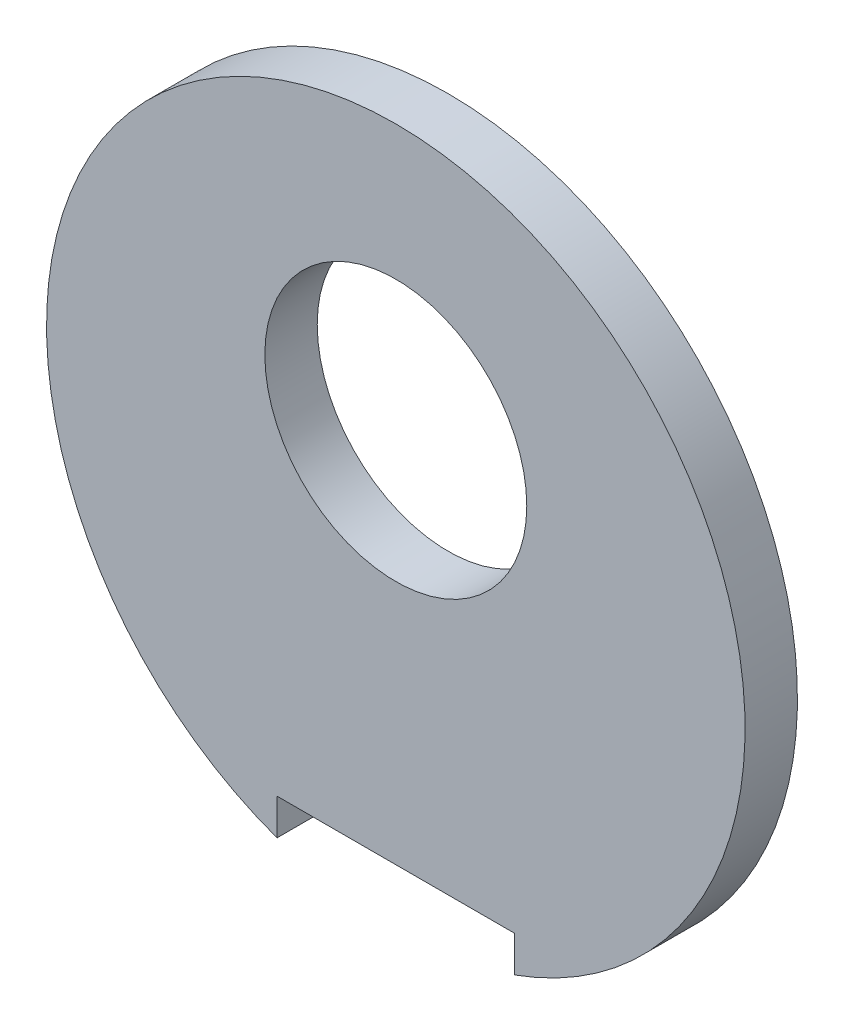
ISO-10303-21;
HEADER;
FILE_DESCRIPTION(('STEP AP214'),'2;1');
FILE_NAME('part.step','',(''),(''),'','','');
FILE_SCHEMA(('AUTOMOTIVE_DESIGN { 1 0 10303 214 1 1 1 1 }'));
ENDSEC;
DATA;
#1=APPLICATION_CONTEXT('core data for automotive mechanical design processes');
#2=APPLICATION_PROTOCOL_DEFINITION('international standard','automotive_design',2000,#1);
#3=PRODUCT_CONTEXT('',#1,'mechanical');
#4=PRODUCT('Part','Part','',(#3));
#5=PRODUCT_RELATED_PRODUCT_CATEGORY('part','',(#4));
#6=PRODUCT_DEFINITION_FORMATION('','',#4);
#7=PRODUCT_DEFINITION_CONTEXT('part definition',#1,'design');
#8=PRODUCT_DEFINITION('design','',#6,#7);
#9=PRODUCT_DEFINITION_SHAPE('','',#8);
#10=(LENGTH_UNIT() NAMED_UNIT(*) SI_UNIT(.MILLI.,.METRE.));
#11=(NAMED_UNIT(*) PLANE_ANGLE_UNIT() SI_UNIT($,.RADIAN.));
#12=(NAMED_UNIT(*) SI_UNIT($,.STERADIAN.) SOLID_ANGLE_UNIT());
#13=UNCERTAINTY_MEASURE_WITH_UNIT(LENGTH_MEASURE(1.E-05),#10,'distance_accuracy_value','');
#14=(GEOMETRIC_REPRESENTATION_CONTEXT(3) GLOBAL_UNCERTAINTY_ASSIGNED_CONTEXT((#13)) GLOBAL_UNIT_ASSIGNED_CONTEXT((#10,
#11,#12)) REPRESENTATION_CONTEXT('',''));
#15=CARTESIAN_POINT('',(0.,0.,0.));
#16=DIRECTION('',(0.,0.,1.));
#17=DIRECTION('',(1.,0.,0.));
#18=AXIS2_PLACEMENT_3D('',#15,#16,#17);
#19=CARTESIAN_POINT('',(0.,0.,3.81));
#20=DIRECTION('',(0.,0.,1.));
#21=DIRECTION('',(1.,0.,0.));
#22=AXIS2_PLACEMENT_3D('',#19,#20,#21);
#23=PLANE('',#22);
#24=CARTESIAN_POINT('',(0.,6.096,3.81));
#25=DIRECTION('',(0.,0.,1.));
#26=DIRECTION('',(1.,0.,0.));
#27=AXIS2_PLACEMENT_3D('',#24,#25,#26);
#28=CIRCLE('',#27,9.525);
#29=CARTESIAN_POINT('',(-9.525,6.096,3.81));
#30=VERTEX_POINT('',#29);
#31=EDGE_CURVE('E99',#30,#30,#28,.T.);
#32=ORIENTED_EDGE('',*,*,#31,.F.);
#33=EDGE_LOOP('',(#32));
#34=FACE_BOUND('',#33,.T.);
#35=CARTESIAN_POINT('',(0.,0.,3.81));
#36=DIRECTION('',(0.,0.,1.));
#37=DIRECTION('',(1.,0.,0.));
#38=AXIS2_PLACEMENT_3D('',#35,#36,#37);
#39=CIRCLE('',#38,25.4);
#40=CARTESIAN_POINT('',(8.636,-23.8868060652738,3.81));
#41=VERTEX_POINT('',#40);
#42=CARTESIAN_POINT('',(-8.63599999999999,-23.8868060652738,3.81));
#43=VERTEX_POINT('',#42);
#44=EDGE_CURVE('E103',#41,#43,#39,.T.);
#45=ORIENTED_EDGE('',*,*,#44,.T.);
#46=DIRECTION('',(0.,-1.,0.));
#47=VECTOR('',#46,1.);
#48=CARTESIAN_POINT('',(-8.63599999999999,-21.2598,3.81));
#49=LINE('',#48,#47);
#50=CARTESIAN_POINT('',(-8.63599999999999,-21.2598,3.81));
#51=VERTEX_POINT('',#50);
#52=EDGE_CURVE('E82',#51,#43,#49,.T.);
#53=ORIENTED_EDGE('',*,*,#52,.F.);
#54=DIRECTION('',(-1.,0.,0.));
#55=VECTOR('',#54,1.);
#56=CARTESIAN_POINT('',(-8.63599999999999,-21.2598,3.81));
#57=LINE('',#56,#55);
#58=CARTESIAN_POINT('',(8.636,-21.2598,3.81));
#59=VERTEX_POINT('',#58);
#60=EDGE_CURVE('E94',#59,#51,#57,.T.);
#61=ORIENTED_EDGE('',*,*,#60,.F.);
#62=DIRECTION('',(0.,1.,0.));
#63=VECTOR('',#62,1.);
#64=CARTESIAN_POINT('',(8.636,-27.7961647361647,3.81));
#65=LINE('',#64,#63);
#66=EDGE_CURVE('E69',#41,#59,#65,.T.);
#67=ORIENTED_EDGE('',*,*,#66,.F.);
#68=EDGE_LOOP('',(#45,#53,#61,#67));
#69=FACE_BOUND('',#68,.T.);
#70=ADVANCED_FACE('F31',(#34,#69),#23,.T.);
#71=CARTESIAN_POINT('',(0.,0.,0.));
#72=DIRECTION('',(0.,0.,1.));
#73=DIRECTION('',(1.,0.,0.));
#74=AXIS2_PLACEMENT_3D('',#71,#72,#73);
#75=PLANE('',#74);
#76=CARTESIAN_POINT('',(0.,6.096,0.));
#77=DIRECTION('',(0.,0.,1.));
#78=DIRECTION('',(1.,0.,0.));
#79=AXIS2_PLACEMENT_3D('',#76,#77,#78);
#80=CIRCLE('',#79,9.525);
#81=CARTESIAN_POINT('',(-9.525,6.096,0.));
#82=VERTEX_POINT('',#81);
#83=EDGE_CURVE('E72',#82,#82,#80,.T.);
#84=ORIENTED_EDGE('',*,*,#83,.T.);
#85=EDGE_LOOP('',(#84));
#86=FACE_BOUND('',#85,.T.);
#87=DIRECTION('',(0.,-1.,0.));
#88=VECTOR('',#87,1.);
#89=CARTESIAN_POINT('',(-8.63599999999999,-21.2598,0.));
#90=LINE('',#89,#88);
#91=CARTESIAN_POINT('',(-8.63599999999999,-21.2598,0.));
#92=VERTEX_POINT('',#91);
#93=CARTESIAN_POINT('',(-8.63599999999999,-23.8868060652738,0.));
#94=VERTEX_POINT('',#93);
#95=EDGE_CURVE('E88',#92,#94,#90,.T.);
#96=ORIENTED_EDGE('',*,*,#95,.T.);
#97=CARTESIAN_POINT('',(0.,0.,0.));
#98=DIRECTION('',(0.,0.,1.));
#99=DIRECTION('',(1.,0.,0.));
#100=AXIS2_PLACEMENT_3D('',#97,#98,#99);
#101=CIRCLE('',#100,25.4);
#102=CARTESIAN_POINT('',(8.636,-23.8868060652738,0.));
#103=VERTEX_POINT('',#102);
#104=EDGE_CURVE('E87',#103,#94,#101,.T.);
#105=ORIENTED_EDGE('',*,*,#104,.F.);
#106=DIRECTION('',(0.,1.,0.));
#107=VECTOR('',#106,1.);
#108=CARTESIAN_POINT('',(8.636,-27.7961647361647,0.));
#109=LINE('',#108,#107);
#110=CARTESIAN_POINT('',(8.636,-21.2598,0.));
#111=VERTEX_POINT('',#110);
#112=EDGE_CURVE('E46',#103,#111,#109,.T.);
#113=ORIENTED_EDGE('',*,*,#112,.T.);
#114=DIRECTION('',(-1.,0.,0.));
#115=VECTOR('',#114,1.);
#116=CARTESIAN_POINT('',(-8.63599999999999,-21.2598,0.));
#117=LINE('',#116,#115);
#118=EDGE_CURVE('E76',#111,#92,#117,.T.);
#119=ORIENTED_EDGE('',*,*,#118,.T.);
#120=EDGE_LOOP('',(#96,#105,#113,#119));
#121=FACE_BOUND('',#120,.T.);
#122=ADVANCED_FACE('F85',(#86,#121),#75,.F.);
#123=CARTESIAN_POINT('',(0.,0.,3.81));
#124=DIRECTION('',(0.,0.,-1.));
#125=DIRECTION('',(-1.,0.,0.));
#126=AXIS2_PLACEMENT_3D('',#123,#124,#125);
#127=CYLINDRICAL_SURFACE('',#126,25.4);
#128=DIRECTION('',(0.,0.,-1.));
#129=VECTOR('',#128,1.);
#130=CARTESIAN_POINT('',(-8.63599999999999,-23.8868060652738,3.81));
#131=LINE('',#130,#129);
#132=EDGE_CURVE('E11',#43,#94,#131,.T.);
#133=ORIENTED_EDGE('',*,*,#132,.F.);
#134=ORIENTED_EDGE('',*,*,#44,.F.);
#135=DIRECTION('',(0.,0.,-1.));
#136=VECTOR('',#135,1.);
#137=CARTESIAN_POINT('',(8.636,-23.8868060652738,3.81));
#138=LINE('',#137,#136);
#139=EDGE_CURVE('E39',#103,#41,#138,.F.);
#140=ORIENTED_EDGE('',*,*,#139,.F.);
#141=ORIENTED_EDGE('',*,*,#104,.T.);
#142=EDGE_LOOP('',(#133,#134,#140,#141));
#143=FACE_BOUND('',#142,.T.);
#144=ADVANCED_FACE('F33',(#143),#127,.T.);
#145=CARTESIAN_POINT('',(0.,6.096,3.81));
#146=DIRECTION('',(0.,0.,-1.));
#147=DIRECTION('',(-1.,0.,0.));
#148=AXIS2_PLACEMENT_3D('',#145,#146,#147);
#149=CYLINDRICAL_SURFACE('',#148,9.525);
#150=CARTESIAN_POINT('',(-9.525,6.096,3.81));
#151=CARTESIAN_POINT('',(-9.525,6.096,3.7703125));
#152=CARTESIAN_POINT('',(-9.525,6.096,3.730625));
#153=CARTESIAN_POINT('',(-9.525,6.096,3.65125));
#154=CARTESIAN_POINT('',(-9.525,6.096,3.6115625));
#155=CARTESIAN_POINT('',(-9.525,6.096,3.5321875));
#156=CARTESIAN_POINT('',(-9.525,6.096,3.4925));
#157=CARTESIAN_POINT('',(-9.525,6.096,3.413125));
#158=CARTESIAN_POINT('',(-9.525,6.096,3.3734375));
#159=CARTESIAN_POINT('',(-9.525,6.096,3.2940625));
#160=CARTESIAN_POINT('',(-9.525,6.096,3.254375));
#161=CARTESIAN_POINT('',(-9.525,6.096,3.175));
#162=CARTESIAN_POINT('',(-9.525,6.096,3.1353125));
#163=CARTESIAN_POINT('',(-9.525,6.096,3.0559375));
#164=CARTESIAN_POINT('',(-9.525,6.096,3.01625));
#165=CARTESIAN_POINT('',(-9.525,6.096,2.936875));
#166=CARTESIAN_POINT('',(-9.525,6.096,2.8971875));
#167=CARTESIAN_POINT('',(-9.525,6.096,2.8178125));
#168=CARTESIAN_POINT('',(-9.525,6.096,2.778125));
#169=CARTESIAN_POINT('',(-9.525,6.096,2.69875));
#170=CARTESIAN_POINT('',(-9.525,6.096,2.6590625));
#171=CARTESIAN_POINT('',(-9.525,6.096,2.5796875));
#172=CARTESIAN_POINT('',(-9.525,6.096,2.54));
#173=CARTESIAN_POINT('',(-9.525,6.096,2.460625));
#174=CARTESIAN_POINT('',(-9.525,6.096,2.4209375));
#175=CARTESIAN_POINT('',(-9.525,6.096,2.3415625));
#176=CARTESIAN_POINT('',(-9.525,6.096,2.301875));
#177=CARTESIAN_POINT('',(-9.525,6.096,2.2225));
#178=CARTESIAN_POINT('',(-9.525,6.096,2.1828125));
#179=CARTESIAN_POINT('',(-9.525,6.096,2.1034375));
#180=CARTESIAN_POINT('',(-9.525,6.096,2.06375));
#181=CARTESIAN_POINT('',(-9.525,6.096,1.984375));
#182=CARTESIAN_POINT('',(-9.525,6.096,1.9446875));
#183=CARTESIAN_POINT('',(-9.525,6.096,1.8653125));
#184=CARTESIAN_POINT('',(-9.525,6.096,1.825625));
#185=CARTESIAN_POINT('',(-9.525,6.096,1.74625));
#186=CARTESIAN_POINT('',(-9.525,6.096,1.7065625));
#187=CARTESIAN_POINT('',(-9.525,6.096,1.6271875));
#188=CARTESIAN_POINT('',(-9.525,6.096,1.5875));
#189=CARTESIAN_POINT('',(-9.525,6.096,1.508125));
#190=CARTESIAN_POINT('',(-9.525,6.096,1.4684375));
#191=CARTESIAN_POINT('',(-9.525,6.096,1.3890625));
#192=CARTESIAN_POINT('',(-9.525,6.096,1.349375));
#193=CARTESIAN_POINT('',(-9.525,6.096,1.27));
#194=CARTESIAN_POINT('',(-9.525,6.096,1.2303125));
#195=CARTESIAN_POINT('',(-9.525,6.096,1.1509375));
#196=CARTESIAN_POINT('',(-9.525,6.096,1.11125));
#197=CARTESIAN_POINT('',(-9.525,6.096,1.031875));
#198=CARTESIAN_POINT('',(-9.525,6.096,0.9921875));
#199=CARTESIAN_POINT('',(-9.525,6.096,0.9128125));
#200=CARTESIAN_POINT('',(-9.525,6.096,0.873125));
#201=CARTESIAN_POINT('',(-9.525,6.096,0.79375));
#202=CARTESIAN_POINT('',(-9.525,6.096,0.7540625));
#203=CARTESIAN_POINT('',(-9.525,6.096,0.6746875));
#204=CARTESIAN_POINT('',(-9.525,6.096,0.635));
#205=CARTESIAN_POINT('',(-9.525,6.096,0.555625));
#206=CARTESIAN_POINT('',(-9.525,6.096,0.5159375));
#207=CARTESIAN_POINT('',(-9.525,6.096,0.4365625));
#208=CARTESIAN_POINT('',(-9.525,6.096,0.396875));
#209=CARTESIAN_POINT('',(-9.525,6.096,0.3175));
#210=CARTESIAN_POINT('',(-9.525,6.096,0.2778125));
#211=CARTESIAN_POINT('',(-9.525,6.096,0.1984375));
#212=CARTESIAN_POINT('',(-9.525,6.096,0.15875));
#213=CARTESIAN_POINT('',(-9.525,6.096,0.0793749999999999));
#214=CARTESIAN_POINT('',(-9.525,6.096,0.0396874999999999));
#215=CARTESIAN_POINT('',(-9.525,6.096,0.));
#216=B_SPLINE_CURVE_WITH_KNOTS('',3,(#150,#151,#152,#153,#154,#155,#156,#157,#158,#159,#160,
#161,#162,#163,#164,#165,#166,#167,#168,#169,#170,#171,#172,#173,#174,#175,#176,#177,#178,#179,
#180,#181,#182,#183,#184,#185,#186,#187,#188,#189,#190,#191,#192,#193,#194,#195,#196,#197,#198,
#199,#200,#201,#202,#203,#204,#205,#206,#207,#208,#209,#210,#211,#212,#213,#214,#215),
.UNSPECIFIED.,.F.,.F.,(4,2,2,2,2,2,2,2,2,2,2,2,2,2,2,2,2,2,2,2,2,2,2,2,2,2,2,2,2,2,2,2,4),(0.,
0.1190625,0.238125,0.3571875,0.47625,0.5953125,0.714375,0.8334375,0.9525,1.0715625,1.190625,
1.3096875,1.42875,1.5478125,1.666875,1.7859375,1.905,2.0240625,2.143125,2.2621875,2.38125,
2.5003125,2.619375,2.7384375,2.8575,2.9765625,3.095625,3.2146875,3.33375,3.4528125,3.571875,
3.6909375,3.81),.UNSPECIFIED.);
#217=EDGE_CURVE('BSEAM113',#30,#82,#216,.T.);
#218=ORIENTED_EDGE('',*,*,#31,.T.);
#219=ORIENTED_EDGE('',*,*,#83,.F.);
#220=ORIENTED_EDGE('',*,*,#217,.T.);
#221=ORIENTED_EDGE('',*,*,#217,.F.);
#222=EDGE_LOOP('',(#218,#220,#219,#221));
#223=FACE_BOUND('',#222,.T.);
#224=ADVANCED_FACE('F113',(#223),#149,.F.);
#225=CARTESIAN_POINT('',(-8.63599999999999,-21.2598,3.81));
#226=DIRECTION('',(1.,0.,0.));
#227=DIRECTION('',(0.,0.,-1.));
#228=AXIS2_PLACEMENT_3D('',#225,#226,#227);
#229=PLANE('',#228);
#230=ORIENTED_EDGE('',*,*,#132,.T.);
#231=ORIENTED_EDGE('',*,*,#95,.F.);
#232=DIRECTION('',(0.,0.,-1.));
#233=VECTOR('',#232,1.);
#234=CARTESIAN_POINT('',(-8.63599999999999,-21.2598,3.81));
#235=LINE('',#234,#233);
#236=EDGE_CURVE('E73',#51,#92,#235,.T.);
#237=ORIENTED_EDGE('',*,*,#236,.F.);
#238=ORIENTED_EDGE('',*,*,#52,.T.);
#239=EDGE_LOOP('',(#230,#231,#237,#238));
#240=FACE_BOUND('',#239,.T.);
#241=ADVANCED_FACE('F111',(#240),#229,.T.);
#242=CARTESIAN_POINT('',(8.636,-27.7961647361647,3.81));
#243=DIRECTION('',(-1.,0.,0.));
#244=DIRECTION('',(0.,0.,1.));
#245=AXIS2_PLACEMENT_3D('',#242,#243,#244);
#246=PLANE('',#245);
#247=ORIENTED_EDGE('',*,*,#139,.T.);
#248=ORIENTED_EDGE('',*,*,#66,.T.);
#249=DIRECTION('',(0.,0.,-1.));
#250=VECTOR('',#249,1.);
#251=CARTESIAN_POINT('',(8.636,-21.2598,3.81));
#252=LINE('',#251,#250);
#253=EDGE_CURVE('E66',#59,#111,#252,.T.);
#254=ORIENTED_EDGE('',*,*,#253,.T.);
#255=ORIENTED_EDGE('',*,*,#112,.F.);
#256=EDGE_LOOP('',(#247,#248,#254,#255));
#257=FACE_BOUND('',#256,.T.);
#258=ADVANCED_FACE('F68',(#257),#246,.T.);
#259=CARTESIAN_POINT('',(-8.63599999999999,-21.2598,3.81));
#260=DIRECTION('',(0.,-1.,0.));
#261=DIRECTION('',(1.,0.,0.));
#262=AXIS2_PLACEMENT_3D('',#259,#260,#261);
#263=PLANE('',#262);
#264=ORIENTED_EDGE('',*,*,#118,.F.);
#265=ORIENTED_EDGE('',*,*,#253,.F.);
#266=ORIENTED_EDGE('',*,*,#60,.T.);
#267=ORIENTED_EDGE('',*,*,#236,.T.);
#268=EDGE_LOOP('',(#264,#265,#266,#267));
#269=FACE_BOUND('',#268,.T.);
#270=ADVANCED_FACE('F77',(#269),#263,.T.);
#271=CLOSED_SHELL('',(#70,#122,#144,#224,#241,#258,#270));
#272=MANIFOLD_SOLID_BREP('B2',#271);
#273=ADVANCED_BREP_SHAPE_REPRESENTATION('',(#18,#272),#14);
#274=SHAPE_DEFINITION_REPRESENTATION(#9,#273);
ENDSEC;
END-ISO-10303-21;
